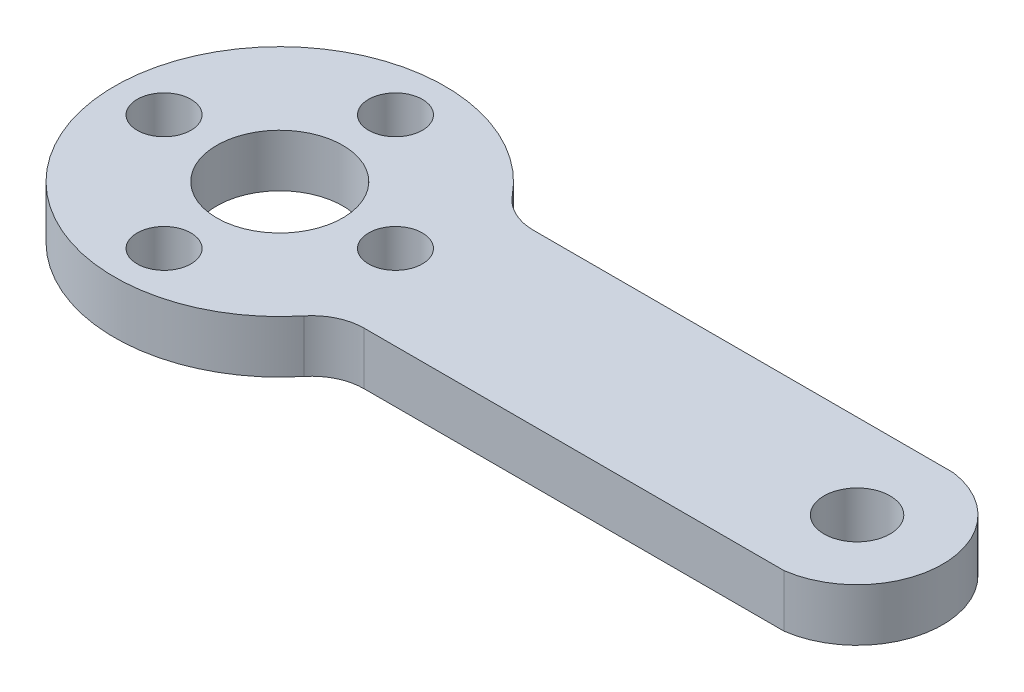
ISO-10303-21;
HEADER;
FILE_DESCRIPTION(('STEP AP214'),'2;1');
FILE_NAME('part.step','',(''),(''),'','','');
FILE_SCHEMA(('AUTOMOTIVE_DESIGN { 1 0 10303 214 1 1 1 1 }'));
ENDSEC;
DATA;
#1=APPLICATION_CONTEXT('core data for automotive mechanical design processes');
#2=APPLICATION_PROTOCOL_DEFINITION('international standard','automotive_design',2000,#1);
#3=PRODUCT_CONTEXT('',#1,'mechanical');
#4=PRODUCT('Part','Part','',(#3));
#5=PRODUCT_RELATED_PRODUCT_CATEGORY('part','',(#4));
#6=PRODUCT_DEFINITION_FORMATION('','',#4);
#7=PRODUCT_DEFINITION_CONTEXT('part definition',#1,'design');
#8=PRODUCT_DEFINITION('design','',#6,#7);
#9=PRODUCT_DEFINITION_SHAPE('','',#8);
#10=(LENGTH_UNIT() NAMED_UNIT(*) SI_UNIT(.MILLI.,.METRE.));
#11=(NAMED_UNIT(*) PLANE_ANGLE_UNIT() SI_UNIT($,.RADIAN.));
#12=(NAMED_UNIT(*) SI_UNIT($,.STERADIAN.) SOLID_ANGLE_UNIT());
#13=UNCERTAINTY_MEASURE_WITH_UNIT(LENGTH_MEASURE(1.E-05),#10,'distance_accuracy_value','');
#14=(GEOMETRIC_REPRESENTATION_CONTEXT(3) GLOBAL_UNCERTAINTY_ASSIGNED_CONTEXT((#13)) GLOBAL_UNIT_ASSIGNED_CONTEXT((#10,
#11,#12)) REPRESENTATION_CONTEXT('',''));
#15=CARTESIAN_POINT('',(0.,0.,0.));
#16=DIRECTION('',(0.,0.,1.));
#17=DIRECTION('',(1.,0.,0.));
#18=AXIS2_PLACEMENT_3D('',#15,#16,#17);
#19=CARTESIAN_POINT('',(0.,3.175,0.));
#20=DIRECTION('',(0.,-1.,0.));
#21=DIRECTION('',(0.,0.,-1.));
#22=AXIS2_PLACEMENT_3D('',#19,#20,#21);
#23=PLANE('',#22);
#24=DIRECTION('',(-1.,0.,0.));
#25=VECTOR('',#24,1.);
#26=CARTESIAN_POINT('',(35.6399427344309,3.175,-5.1253762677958));
#27=LINE('',#26,#25);
#28=CARTESIAN_POINT('',(35.6399427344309,3.175,-5.1253762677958));
#29=VERTEX_POINT('',#28);
#30=CARTESIAN_POINT('',(10.2315384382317,3.175,-5.1253762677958));
#31=VERTEX_POINT('',#30);
#32=EDGE_CURVE('E121',#29,#31,#27,.T.);
#33=ORIENTED_EDGE('',*,*,#32,.T.);
#34=CARTESIAN_POINT('',(10.2315384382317,3.175,-8.3003762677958));
#35=DIRECTION('',(0.,-1.,0.));
#36=DIRECTION('',(0.,0.,-1.));
#37=AXIS2_PLACEMENT_3D('',#34,#35,#36);
#38=CIRCLE('',#37,3.175);
#39=CARTESIAN_POINT('',(7.76587357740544,3.175,-6.3000958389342));
#40=VERTEX_POINT('',#39);
#41=EDGE_CURVE('E11',#31,#40,#38,.T.);
#42=ORIENTED_EDGE('',*,*,#41,.T.);
#43=CARTESIAN_POINT('',(0.,3.175,0.));
#44=DIRECTION('',(0.,1.,0.));
#45=DIRECTION('',(0.,0.,-1.));
#46=AXIS2_PLACEMENT_3D('',#43,#44,#45);
#47=CIRCLE('',#46,10.);
#48=CARTESIAN_POINT('',(7.76587357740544,3.175,6.3000958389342));
#49=VERTEX_POINT('',#48);
#50=EDGE_CURVE('E105',#40,#49,#47,.T.);
#51=ORIENTED_EDGE('',*,*,#50,.T.);
#52=CARTESIAN_POINT('',(10.2315384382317,3.175,8.3003762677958));
#53=DIRECTION('',(0.,-1.,0.));
#54=DIRECTION('',(0.,0.,-1.));
#55=AXIS2_PLACEMENT_3D('',#52,#53,#54);
#56=CIRCLE('',#55,3.175);
#57=CARTESIAN_POINT('',(10.2315384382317,3.175,5.1253762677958));
#58=VERTEX_POINT('',#57);
#59=EDGE_CURVE('E100',#49,#58,#56,.T.);
#60=ORIENTED_EDGE('',*,*,#59,.T.);
#61=DIRECTION('',(1.,0.,0.));
#62=VECTOR('',#61,1.);
#63=CARTESIAN_POINT('',(35.6399427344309,3.175,5.1253762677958));
#64=LINE('',#63,#62);
#65=CARTESIAN_POINT('',(35.6399427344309,3.175,5.1253762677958));
#66=VERTEX_POINT('',#65);
#67=EDGE_CURVE('E92',#58,#66,#64,.T.);
#68=ORIENTED_EDGE('',*,*,#67,.T.);
#69=CARTESIAN_POINT('',(34.925,3.175,0.));
#70=DIRECTION('',(0.,1.,0.));
#71=DIRECTION('',(0.,0.,1.));
#72=AXIS2_PLACEMENT_3D('',#69,#70,#71);
#73=CIRCLE('',#72,5.175);
#74=EDGE_CURVE('E96',#66,#29,#73,.T.);
#75=ORIENTED_EDGE('',*,*,#74,.T.);
#76=EDGE_LOOP('',(#33,#42,#51,#60,#68,#75));
#77=FACE_BOUND('',#76,.T.);
#78=CARTESIAN_POINT('',(0.,3.175,0.));
#79=DIRECTION('',(0.,1.,0.));
#80=DIRECTION('',(0.,0.,1.));
#81=AXIS2_PLACEMENT_3D('',#78,#79,#80);
#82=CIRCLE('',#81,3.81);
#83=CARTESIAN_POINT('',(0.,3.175,3.81));
#84=VERTEX_POINT('',#83);
#85=EDGE_CURVE('E131',#84,#84,#82,.T.);
#86=ORIENTED_EDGE('',*,*,#85,.F.);
#87=EDGE_LOOP('',(#86));
#88=FACE_BOUND('',#87,.T.);
#89=CARTESIAN_POINT('',(34.925,3.175,0.));
#90=DIRECTION('',(0.,1.,0.));
#91=DIRECTION('',(0.,0.,1.));
#92=AXIS2_PLACEMENT_3D('',#89,#90,#91);
#93=CIRCLE('',#92,2.);
#94=CARTESIAN_POINT('',(34.925,3.175,2.));
#95=VERTEX_POINT('',#94);
#96=EDGE_CURVE('E333',#95,#95,#93,.T.);
#97=ORIENTED_EDGE('',*,*,#96,.F.);
#98=EDGE_LOOP('',(#97));
#99=FACE_BOUND('',#98,.T.);
#100=CARTESIAN_POINT('',(0.,3.175,-7.));
#101=DIRECTION('',(0.,1.,0.));
#102=DIRECTION('',(0.,0.,1.));
#103=AXIS2_PLACEMENT_3D('',#100,#101,#102);
#104=CIRCLE('',#103,1.627000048);
#105=CARTESIAN_POINT('',(0.,3.175,-5.372999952));
#106=VERTEX_POINT('',#105);
#107=EDGE_CURVE('E325',#106,#106,#104,.T.);
#108=ORIENTED_EDGE('',*,*,#107,.F.);
#109=EDGE_LOOP('',(#108));
#110=FACE_BOUND('',#109,.T.);
#111=CARTESIAN_POINT('',(7.,3.175,0.));
#112=DIRECTION('',(0.,1.,0.));
#113=DIRECTION('',(0.,0.,1.));
#114=AXIS2_PLACEMENT_3D('',#111,#112,#113);
#115=CIRCLE('',#114,1.627000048);
#116=CARTESIAN_POINT('',(7.,3.175,1.627000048));
#117=VERTEX_POINT('',#116);
#118=EDGE_CURVE('E317',#117,#117,#115,.T.);
#119=ORIENTED_EDGE('',*,*,#118,.F.);
#120=EDGE_LOOP('',(#119));
#121=FACE_BOUND('',#120,.T.);
#122=CARTESIAN_POINT('',(0.,3.175,7.));
#123=DIRECTION('',(0.,1.,0.));
#124=DIRECTION('',(0.,0.,1.));
#125=AXIS2_PLACEMENT_3D('',#122,#123,#124);
#126=CIRCLE('',#125,1.627000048);
#127=CARTESIAN_POINT('',(0.,3.175,8.627000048));
#128=VERTEX_POINT('',#127);
#129=EDGE_CURVE('E301',#128,#128,#126,.T.);
#130=ORIENTED_EDGE('',*,*,#129,.F.);
#131=EDGE_LOOP('',(#130));
#132=FACE_BOUND('',#131,.T.);
#133=CARTESIAN_POINT('',(-7.,3.175,0.));
#134=DIRECTION('',(0.,1.,0.));
#135=DIRECTION('',(0.,0.,1.));
#136=AXIS2_PLACEMENT_3D('',#133,#134,#135);
#137=CIRCLE('',#136,1.627000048);
#138=CARTESIAN_POINT('',(-7.,3.175,1.627000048));
#139=VERTEX_POINT('',#138);
#140=EDGE_CURVE('E306',#139,#139,#137,.T.);
#141=ORIENTED_EDGE('',*,*,#140,.F.);
#142=EDGE_LOOP('',(#141));
#143=FACE_BOUND('',#142,.T.);
#144=ADVANCED_FACE('F39',(#77,#88,#99,#110,#121,#132,#143),#23,.F.);
#145=CARTESIAN_POINT('',(0.,0.,0.));
#146=DIRECTION('',(0.,-1.,0.));
#147=DIRECTION('',(0.,0.,-1.));
#148=AXIS2_PLACEMENT_3D('',#145,#146,#147);
#149=PLANE('',#148);
#150=CARTESIAN_POINT('',(0.,0.,7.));
#151=DIRECTION('',(0.,1.,0.));
#152=DIRECTION('',(0.,0.,1.));
#153=AXIS2_PLACEMENT_3D('',#150,#151,#152);
#154=CIRCLE('',#153,1.627000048);
#155=CARTESIAN_POINT('',(0.,0.,8.627000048));
#156=VERTEX_POINT('',#155);
#157=EDGE_CURVE('E304',#156,#156,#154,.T.);
#158=ORIENTED_EDGE('',*,*,#157,.T.);
#159=EDGE_LOOP('',(#158));
#160=FACE_BOUND('',#159,.T.);
#161=CARTESIAN_POINT('',(0.,0.,-7.));
#162=DIRECTION('',(0.,1.,0.));
#163=DIRECTION('',(0.,0.,1.));
#164=AXIS2_PLACEMENT_3D('',#161,#162,#163);
#165=CIRCLE('',#164,1.627000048);
#166=CARTESIAN_POINT('',(0.,0.,-5.372999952));
#167=VERTEX_POINT('',#166);
#168=EDGE_CURVE('E321',#167,#167,#165,.T.);
#169=ORIENTED_EDGE('',*,*,#168,.T.);
#170=EDGE_LOOP('',(#169));
#171=FACE_BOUND('',#170,.T.);
#172=CARTESIAN_POINT('',(0.,0.,0.));
#173=DIRECTION('',(0.,1.,0.));
#174=DIRECTION('',(0.,0.,1.));
#175=AXIS2_PLACEMENT_3D('',#172,#173,#174);
#176=CIRCLE('',#175,3.81);
#177=CARTESIAN_POINT('',(0.,0.,3.81));
#178=VERTEX_POINT('',#177);
#179=EDGE_CURVE('E337',#178,#178,#176,.T.);
#180=ORIENTED_EDGE('',*,*,#179,.T.);
#181=EDGE_LOOP('',(#180));
#182=FACE_BOUND('',#181,.T.);
#183=CARTESIAN_POINT('',(0.,0.,0.));
#184=DIRECTION('',(0.,1.,0.));
#185=DIRECTION('',(0.,0.,1.));
#186=AXIS2_PLACEMENT_3D('',#183,#184,#185);
#187=CIRCLE('',#186,10.);
#188=CARTESIAN_POINT('',(7.76587357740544,0.,-6.3000958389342));
#189=VERTEX_POINT('',#188);
#190=CARTESIAN_POINT('',(7.76587357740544,0.,6.3000958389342));
#191=VERTEX_POINT('',#190);
#192=EDGE_CURVE('E127',#189,#191,#187,.T.);
#193=ORIENTED_EDGE('',*,*,#192,.F.);
#194=CARTESIAN_POINT('',(10.2315384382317,0.,-8.3003762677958));
#195=DIRECTION('',(0.,-1.,0.));
#196=DIRECTION('',(0.,0.,-1.));
#197=AXIS2_PLACEMENT_3D('',#194,#195,#196);
#198=CIRCLE('',#197,3.175);
#199=CARTESIAN_POINT('',(10.2315384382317,0.,-5.1253762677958));
#200=VERTEX_POINT('',#199);
#201=EDGE_CURVE('E48',#189,#200,#198,.F.);
#202=ORIENTED_EDGE('',*,*,#201,.T.);
#203=DIRECTION('',(-1.,0.,0.));
#204=VECTOR('',#203,1.);
#205=CARTESIAN_POINT('',(35.6399427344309,0.,-5.1253762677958));
#206=LINE('',#205,#204);
#207=CARTESIAN_POINT('',(35.6399427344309,0.,-5.1253762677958));
#208=VERTEX_POINT('',#207);
#209=EDGE_CURVE('E137',#208,#200,#206,.T.);
#210=ORIENTED_EDGE('',*,*,#209,.F.);
#211=CARTESIAN_POINT('',(34.925,0.,0.));
#212=DIRECTION('',(0.,1.,0.));
#213=DIRECTION('',(0.,0.,1.));
#214=AXIS2_PLACEMENT_3D('',#211,#212,#213);
#215=CIRCLE('',#214,5.175);
#216=CARTESIAN_POINT('',(35.6399427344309,0.,5.1253762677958));
#217=VERTEX_POINT('',#216);
#218=EDGE_CURVE('E134',#217,#208,#215,.T.);
#219=ORIENTED_EDGE('',*,*,#218,.F.);
#220=DIRECTION('',(1.,0.,0.));
#221=VECTOR('',#220,1.);
#222=CARTESIAN_POINT('',(35.6399427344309,0.,5.1253762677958));
#223=LINE('',#222,#221);
#224=CARTESIAN_POINT('',(10.2315384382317,0.,5.1253762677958));
#225=VERTEX_POINT('',#224);
#226=EDGE_CURVE('E111',#225,#217,#223,.T.);
#227=ORIENTED_EDGE('',*,*,#226,.F.);
#228=CARTESIAN_POINT('',(10.2315384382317,0.,8.3003762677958));
#229=DIRECTION('',(0.,-1.,0.));
#230=DIRECTION('',(0.,0.,-1.));
#231=AXIS2_PLACEMENT_3D('',#228,#229,#230);
#232=CIRCLE('',#231,3.175);
#233=EDGE_CURVE('E153',#225,#191,#232,.F.);
#234=ORIENTED_EDGE('',*,*,#233,.T.);
#235=EDGE_LOOP('',(#193,#202,#210,#219,#227,#234));
#236=FACE_BOUND('',#235,.T.);
#237=CARTESIAN_POINT('',(34.925,0.,0.));
#238=DIRECTION('',(0.,1.,0.));
#239=DIRECTION('',(0.,0.,1.));
#240=AXIS2_PLACEMENT_3D('',#237,#238,#239);
#241=CIRCLE('',#240,2.);
#242=CARTESIAN_POINT('',(34.925,0.,2.));
#243=VERTEX_POINT('',#242);
#244=EDGE_CURVE('E329',#243,#243,#241,.T.);
#245=ORIENTED_EDGE('',*,*,#244,.T.);
#246=EDGE_LOOP('',(#245));
#247=FACE_BOUND('',#246,.T.);
#248=CARTESIAN_POINT('',(7.,0.,0.));
#249=DIRECTION('',(0.,1.,0.));
#250=DIRECTION('',(0.,0.,1.));
#251=AXIS2_PLACEMENT_3D('',#248,#249,#250);
#252=CIRCLE('',#251,1.627000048);
#253=CARTESIAN_POINT('',(7.,0.,1.627000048));
#254=VERTEX_POINT('',#253);
#255=EDGE_CURVE('E310',#254,#254,#252,.T.);
#256=ORIENTED_EDGE('',*,*,#255,.T.);
#257=EDGE_LOOP('',(#256));
#258=FACE_BOUND('',#257,.T.);
#259=CARTESIAN_POINT('',(-7.,0.,0.));
#260=DIRECTION('',(0.,1.,0.));
#261=DIRECTION('',(0.,0.,1.));
#262=AXIS2_PLACEMENT_3D('',#259,#260,#261);
#263=CIRCLE('',#262,1.627000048);
#264=CARTESIAN_POINT('',(-7.,0.,1.627000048));
#265=VERTEX_POINT('',#264);
#266=EDGE_CURVE('E313',#265,#265,#263,.T.);
#267=ORIENTED_EDGE('',*,*,#266,.T.);
#268=EDGE_LOOP('',(#267));
#269=FACE_BOUND('',#268,.T.);
#270=ADVANCED_FACE('F158',(#160,#171,#182,#236,#247,#258,#269),#149,.T.);
#271=CARTESIAN_POINT('',(0.,3.175,0.));
#272=DIRECTION('',(0.,-1.,0.));
#273=DIRECTION('',(0.,0.,-1.));
#274=AXIS2_PLACEMENT_3D('',#271,#272,#273);
#275=CYLINDRICAL_SURFACE('',#274,10.);
#276=ORIENTED_EDGE('',*,*,#192,.T.);
#277=DIRECTION('',(0.,-1.,0.));
#278=VECTOR('',#277,1.);
#279=CARTESIAN_POINT('',(7.76587357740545,3.175,6.3000958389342));
#280=LINE('',#279,#278);
#281=EDGE_CURVE('E148',#191,#49,#280,.F.);
#282=ORIENTED_EDGE('',*,*,#281,.T.);
#283=ORIENTED_EDGE('',*,*,#50,.F.);
#284=DIRECTION('',(0.,-1.,0.));
#285=VECTOR('',#284,1.);
#286=CARTESIAN_POINT('',(7.76587357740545,3.175,-6.3000958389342));
#287=LINE('',#286,#285);
#288=EDGE_CURVE('E144',#40,#189,#287,.T.);
#289=ORIENTED_EDGE('',*,*,#288,.T.);
#290=EDGE_LOOP('',(#276,#282,#283,#289));
#291=FACE_BOUND('',#290,.T.);
#292=ADVANCED_FACE('F163',(#291),#275,.T.);
#293=CARTESIAN_POINT('',(35.6399427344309,3.175,5.1253762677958));
#294=DIRECTION('',(0.,0.,-1.));
#295=DIRECTION('',(-1.,0.,0.));
#296=AXIS2_PLACEMENT_3D('',#293,#294,#295);
#297=PLANE('',#296);
#298=ORIENTED_EDGE('',*,*,#67,.F.);
#299=DIRECTION('',(0.,1.,0.));
#300=VECTOR('',#299,1.);
#301=CARTESIAN_POINT('',(10.2315384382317,0.,5.1253762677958));
#302=LINE('',#301,#300);
#303=EDGE_CURVE('E115',#58,#225,#302,.F.);
#304=ORIENTED_EDGE('',*,*,#303,.T.);
#305=ORIENTED_EDGE('',*,*,#226,.T.);
#306=DIRECTION('',(0.,-1.,0.));
#307=VECTOR('',#306,1.);
#308=CARTESIAN_POINT('',(35.6399427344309,3.175,5.1253762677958));
#309=LINE('',#308,#307);
#310=EDGE_CURVE('E108',#66,#217,#309,.T.);
#311=ORIENTED_EDGE('',*,*,#310,.F.);
#312=EDGE_LOOP('',(#298,#304,#305,#311));
#313=FACE_BOUND('',#312,.T.);
#314=ADVANCED_FACE('F109',(#313),#297,.F.);
#315=CARTESIAN_POINT('',(34.925,3.175,0.));
#316=DIRECTION('',(0.,-1.,0.));
#317=DIRECTION('',(0.,0.,-1.));
#318=AXIS2_PLACEMENT_3D('',#315,#316,#317);
#319=CYLINDRICAL_SURFACE('',#318,5.175);
#320=ORIENTED_EDGE('',*,*,#218,.T.);
#321=DIRECTION('',(0.,-1.,0.));
#322=VECTOR('',#321,1.);
#323=CARTESIAN_POINT('',(35.6399427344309,3.175,-5.1253762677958));
#324=LINE('',#323,#322);
#325=EDGE_CURVE('E116',#29,#208,#324,.T.);
#326=ORIENTED_EDGE('',*,*,#325,.F.);
#327=ORIENTED_EDGE('',*,*,#74,.F.);
#328=ORIENTED_EDGE('',*,*,#310,.T.);
#329=EDGE_LOOP('',(#320,#326,#327,#328));
#330=FACE_BOUND('',#329,.T.);
#331=ADVANCED_FACE('F118',(#330),#319,.T.);
#332=CARTESIAN_POINT('',(35.6399427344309,3.175,-5.1253762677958));
#333=DIRECTION('',(0.,0.,1.));
#334=DIRECTION('',(1.,0.,0.));
#335=AXIS2_PLACEMENT_3D('',#332,#333,#334);
#336=PLANE('',#335);
#337=ORIENTED_EDGE('',*,*,#209,.T.);
#338=DIRECTION('',(0.,1.,0.));
#339=VECTOR('',#338,1.);
#340=CARTESIAN_POINT('',(10.2315384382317,3.175,-5.1253762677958));
#341=LINE('',#340,#339);
#342=EDGE_CURVE('E55',#200,#31,#341,.T.);
#343=ORIENTED_EDGE('',*,*,#342,.T.);
#344=ORIENTED_EDGE('',*,*,#32,.F.);
#345=ORIENTED_EDGE('',*,*,#325,.T.);
#346=EDGE_LOOP('',(#337,#343,#344,#345));
#347=FACE_BOUND('',#346,.T.);
#348=ADVANCED_FACE('F189',(#347),#336,.F.);
#349=CARTESIAN_POINT('',(0.,3.175,0.));
#350=DIRECTION('',(0.,-1.,0.));
#351=DIRECTION('',(0.,0.,-1.));
#352=AXIS2_PLACEMENT_3D('',#349,#350,#351);
#353=CYLINDRICAL_SURFACE('',#352,3.81);
#354=ORIENTED_EDGE('',*,*,#85,.T.);
#355=EDGE_LOOP('',(#354));
#356=FACE_BOUND('',#355,.T.);
#357=ORIENTED_EDGE('',*,*,#179,.F.);
#358=EDGE_LOOP('',(#357));
#359=FACE_BOUND('',#358,.T.);
#360=ADVANCED_FACE('F186',(#356,#359),#353,.F.);
#361=CARTESIAN_POINT('',(34.925,3.175,0.));
#362=DIRECTION('',(0.,-1.,0.));
#363=DIRECTION('',(0.,0.,-1.));
#364=AXIS2_PLACEMENT_3D('',#361,#362,#363);
#365=CYLINDRICAL_SURFACE('',#364,2.);
#366=ORIENTED_EDGE('',*,*,#96,.T.);
#367=EDGE_LOOP('',(#366));
#368=FACE_BOUND('',#367,.T.);
#369=ORIENTED_EDGE('',*,*,#244,.F.);
#370=EDGE_LOOP('',(#369));
#371=FACE_BOUND('',#370,.T.);
#372=ADVANCED_FACE('F218',(#368,#371),#365,.F.);
#373=CARTESIAN_POINT('',(0.,3.175,-7.));
#374=DIRECTION('',(0.,-1.,0.));
#375=DIRECTION('',(0.,0.,-1.));
#376=AXIS2_PLACEMENT_3D('',#373,#374,#375);
#377=CYLINDRICAL_SURFACE('',#376,1.627000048);
#378=ORIENTED_EDGE('',*,*,#107,.T.);
#379=EDGE_LOOP('',(#378));
#380=FACE_BOUND('',#379,.T.);
#381=ORIENTED_EDGE('',*,*,#168,.F.);
#382=EDGE_LOOP('',(#381));
#383=FACE_BOUND('',#382,.T.);
#384=ADVANCED_FACE('F225',(#380,#383),#377,.F.);
#385=CARTESIAN_POINT('',(7.,3.175,0.));
#386=DIRECTION('',(0.,-1.,0.));
#387=DIRECTION('',(0.,0.,-1.));
#388=AXIS2_PLACEMENT_3D('',#385,#386,#387);
#389=CYLINDRICAL_SURFACE('',#388,1.627000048);
#390=ORIENTED_EDGE('',*,*,#118,.T.);
#391=EDGE_LOOP('',(#390));
#392=FACE_BOUND('',#391,.T.);
#393=ORIENTED_EDGE('',*,*,#255,.F.);
#394=EDGE_LOOP('',(#393));
#395=FACE_BOUND('',#394,.T.);
#396=ADVANCED_FACE('F232',(#392,#395),#389,.F.);
#397=CARTESIAN_POINT('',(0.,3.175,7.));
#398=DIRECTION('',(0.,-1.,0.));
#399=DIRECTION('',(0.,0.,-1.));
#400=AXIS2_PLACEMENT_3D('',#397,#398,#399);
#401=CYLINDRICAL_SURFACE('',#400,1.627000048);
#402=ORIENTED_EDGE('',*,*,#129,.T.);
#403=EDGE_LOOP('',(#402));
#404=FACE_BOUND('',#403,.T.);
#405=ORIENTED_EDGE('',*,*,#157,.F.);
#406=EDGE_LOOP('',(#405));
#407=FACE_BOUND('',#406,.T.);
#408=ADVANCED_FACE('F174',(#404,#407),#401,.F.);
#409=CARTESIAN_POINT('',(-7.,3.175,0.));
#410=DIRECTION('',(0.,-1.,0.));
#411=DIRECTION('',(0.,0.,-1.));
#412=AXIS2_PLACEMENT_3D('',#409,#410,#411);
#413=CYLINDRICAL_SURFACE('',#412,1.627000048);
#414=ORIENTED_EDGE('',*,*,#140,.T.);
#415=EDGE_LOOP('',(#414));
#416=FACE_BOUND('',#415,.T.);
#417=ORIENTED_EDGE('',*,*,#266,.F.);
#418=EDGE_LOOP('',(#417));
#419=FACE_BOUND('',#418,.T.);
#420=ADVANCED_FACE('F168',(#416,#419),#413,.F.);
#421=CARTESIAN_POINT('',(10.2315384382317,3.175,8.3003762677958));
#422=DIRECTION('',(0.,-1.,0.));
#423=DIRECTION('',(0.,0.,-1.));
#424=AXIS2_PLACEMENT_3D('',#421,#422,#423);
#425=CYLINDRICAL_SURFACE('',#424,3.175);
#426=ORIENTED_EDGE('',*,*,#59,.F.);
#427=ORIENTED_EDGE('',*,*,#281,.F.);
#428=ORIENTED_EDGE('',*,*,#233,.F.);
#429=ORIENTED_EDGE('',*,*,#303,.F.);
#430=EDGE_LOOP('',(#426,#427,#428,#429));
#431=FACE_BOUND('',#430,.T.);
#432=ADVANCED_FACE('F166',(#431),#425,.F.);
#433=CARTESIAN_POINT('',(10.2315384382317,3.175,-8.3003762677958));
#434=DIRECTION('',(0.,-1.,0.));
#435=DIRECTION('',(0.,0.,-1.));
#436=AXIS2_PLACEMENT_3D('',#433,#434,#435);
#437=CYLINDRICAL_SURFACE('',#436,3.175);
#438=ORIENTED_EDGE('',*,*,#41,.F.);
#439=ORIENTED_EDGE('',*,*,#342,.F.);
#440=ORIENTED_EDGE('',*,*,#201,.F.);
#441=ORIENTED_EDGE('',*,*,#288,.F.);
#442=EDGE_LOOP('',(#438,#439,#440,#441));
#443=FACE_BOUND('',#442,.T.);
#444=ADVANCED_FACE('F41',(#443),#437,.F.);
#445=CLOSED_SHELL('',(#144,#270,#292,#314,#331,#348,#360,#372,#384,#396,#408,#420,#432,#444));
#446=MANIFOLD_SOLID_BREP('B2',#445);
#447=ADVANCED_BREP_SHAPE_REPRESENTATION('',(#18,#446),#14);
#448=SHAPE_DEFINITION_REPRESENTATION(#9,#447);
ENDSEC;
END-ISO-10303-21;
